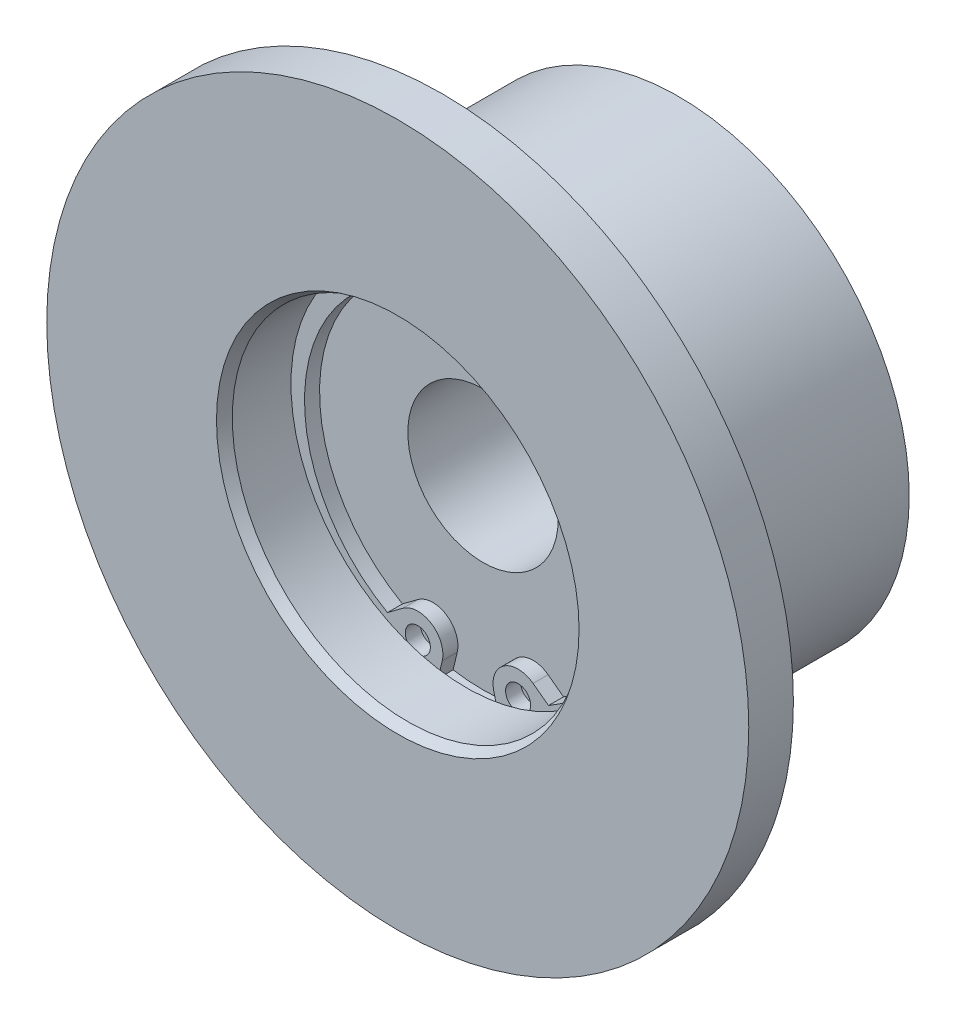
ISO-10303-21;
HEADER;
FILE_DESCRIPTION(('STEP AP214'),'2;1');
FILE_NAME('part.step','',(''),(''),'','','');
FILE_SCHEMA(('AUTOMOTIVE_DESIGN { 1 0 10303 214 1 1 1 1 }'));
ENDSEC;
DATA;
#1=APPLICATION_CONTEXT('core data for automotive mechanical design processes');
#2=APPLICATION_PROTOCOL_DEFINITION('international standard','automotive_design',2000,#1);
#3=PRODUCT_CONTEXT('',#1,'mechanical');
#4=PRODUCT('Part','Part','',(#3));
#5=PRODUCT_RELATED_PRODUCT_CATEGORY('part','',(#4));
#6=PRODUCT_DEFINITION_FORMATION('','',#4);
#7=PRODUCT_DEFINITION_CONTEXT('part definition',#1,'design');
#8=PRODUCT_DEFINITION('design','',#6,#7);
#9=PRODUCT_DEFINITION_SHAPE('','',#8);
#10=(LENGTH_UNIT() NAMED_UNIT(*) SI_UNIT(.MILLI.,.METRE.));
#11=(NAMED_UNIT(*) PLANE_ANGLE_UNIT() SI_UNIT($,.RADIAN.));
#12=(NAMED_UNIT(*) SI_UNIT($,.STERADIAN.) SOLID_ANGLE_UNIT());
#13=UNCERTAINTY_MEASURE_WITH_UNIT(LENGTH_MEASURE(1.E-05),#10,'distance_accuracy_value','');
#14=(GEOMETRIC_REPRESENTATION_CONTEXT(3) GLOBAL_UNCERTAINTY_ASSIGNED_CONTEXT((#13)) GLOBAL_UNIT_ASSIGNED_CONTEXT((#10,
#11,#12)) REPRESENTATION_CONTEXT('',''));
#15=CARTESIAN_POINT('',(0.,0.,0.));
#16=DIRECTION('',(0.,0.,1.));
#17=DIRECTION('',(1.,0.,0.));
#18=AXIS2_PLACEMENT_3D('',#15,#16,#17);
#19=CARTESIAN_POINT('',(0.,-0.9,7.1));
#20=DIRECTION('',(0.,0.,1.));
#21=DIRECTION('',(-1.,0.,0.));
#22=AXIS2_PLACEMENT_3D('',#19,#20,#21);
#23=CYLINDRICAL_SURFACE('',#22,16.3);
#24=CARTESIAN_POINT('',(0.,-0.9,7.));
#25=DIRECTION('',(0.,0.,1.));
#26=DIRECTION('',(1.,0.,0.));
#27=AXIS2_PLACEMENT_3D('',#24,#25,#26);
#28=CIRCLE('',#27,16.3);
#29=CARTESIAN_POINT('',(-8.02922574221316,-15.0852576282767,7.));
#30=VERTEX_POINT('',#29);
#31=CARTESIAN_POINT('',(8.02922574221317,-15.0852576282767,7.));
#32=VERTEX_POINT('',#31);
#33=EDGE_CURVE('E207',#30,#32,#28,.F.);
#34=ORIENTED_EDGE('',*,*,#33,.F.);
#35=DIRECTION('',(0.,0.,-1.));
#36=VECTOR('',#35,1.);
#37=CARTESIAN_POINT('',(-8.02922574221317,-15.0852576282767,7.1));
#38=LINE('',#37,#36);
#39=CARTESIAN_POINT('',(-8.02922574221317,-15.0852576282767,5.5));
#40=VERTEX_POINT('',#39);
#41=EDGE_CURVE('E127',#30,#40,#38,.T.);
#42=ORIENTED_EDGE('',*,*,#41,.T.);
#43=CARTESIAN_POINT('',(0.,-0.9,5.5));
#44=DIRECTION('',(0.,0.,-1.));
#45=DIRECTION('',(-1.,0.,0.));
#46=AXIS2_PLACEMENT_3D('',#43,#44,#45);
#47=CIRCLE('',#46,16.3);
#48=CARTESIAN_POINT('',(8.02922574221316,-15.0852576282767,5.5));
#49=VERTEX_POINT('',#48);
#50=EDGE_CURVE('E142',#40,#49,#47,.T.);
#51=ORIENTED_EDGE('',*,*,#50,.T.);
#52=DIRECTION('',(0.,0.,-1.));
#53=VECTOR('',#52,1.);
#54=CARTESIAN_POINT('',(8.02922574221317,-15.0852576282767,7.1));
#55=LINE('',#54,#53);
#56=EDGE_CURVE('E130',#32,#49,#55,.T.);
#57=ORIENTED_EDGE('',*,*,#56,.F.);
#58=EDGE_LOOP('',(#34,#42,#51,#57));
#59=FACE_BOUND('',#58,.T.);
#60=ADVANCED_FACE('F14',(#59),#23,.F.);
#61=CARTESIAN_POINT('',(6.49138441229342,-13.9421779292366,7.1));
#62=DIRECTION('',(-0.596553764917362,-0.802573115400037,0.));
#63=DIRECTION('',(-0.802573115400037,0.596553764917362,0.));
#64=AXIS2_PLACEMENT_3D('',#61,#62,#63);
#65=PLANE('',#64);
#66=DIRECTION('',(-0.802573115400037,0.596553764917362,0.));
#67=VECTOR('',#66,1.);
#68=CARTESIAN_POINT('',(6.49138441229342,-13.9421779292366,7.));
#69=LINE('',#68,#67);
#70=CARTESIAN_POINT('',(6.49138441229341,-13.9421779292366,7.));
#71=VERTEX_POINT('',#70);
#72=EDGE_CURVE('E209',#32,#71,#69,.T.);
#73=ORIENTED_EDGE('',*,*,#72,.F.);
#74=ORIENTED_EDGE('',*,*,#56,.T.);
#75=DIRECTION('',(-0.802573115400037,0.596553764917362,0.));
#76=VECTOR('',#75,1.);
#77=CARTESIAN_POINT('',(-7.95591287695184,-3.20348082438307,5.5));
#78=LINE('',#77,#76);
#79=CARTESIAN_POINT('',(6.49138441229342,-13.9421779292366,5.5));
#80=VERTEX_POINT('',#79);
#81=EDGE_CURVE('E138',#49,#80,#78,.T.);
#82=ORIENTED_EDGE('',*,*,#81,.T.);
#83=DIRECTION('',(0.,0.,-1.));
#84=VECTOR('',#83,1.);
#85=CARTESIAN_POINT('',(6.49138441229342,-13.9421779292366,7.1));
#86=LINE('',#85,#84);
#87=EDGE_CURVE('E122',#71,#80,#86,.T.);
#88=ORIENTED_EDGE('',*,*,#87,.F.);
#89=EDGE_LOOP('',(#73,#74,#82,#88));
#90=FACE_BOUND('',#89,.T.);
#91=ADVANCED_FACE('F217',(#90),#65,.F.);
#92=CARTESIAN_POINT('',(5.,-15.9486107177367,7.1));
#93=DIRECTION('',(0.,0.,1.));
#94=DIRECTION('',(-1.,0.,0.));
#95=AXIS2_PLACEMENT_3D('',#92,#93,#94);
#96=CYLINDRICAL_SURFACE('',#95,2.5);
#97=DIRECTION('',(0.,0.,-1.));
#98=VECTOR('',#97,1.);
#99=CARTESIAN_POINT('',(2.5678231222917,-16.526983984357,7.1));
#100=LINE('',#99,#98);
#101=CARTESIAN_POINT('',(2.5678231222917,-16.526983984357,7.));
#102=VERTEX_POINT('',#101);
#103=CARTESIAN_POINT('',(2.56782312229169,-16.526983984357,5.5));
#104=VERTEX_POINT('',#103);
#105=EDGE_CURVE('E40',#102,#104,#100,.T.);
#106=ORIENTED_EDGE('',*,*,#105,.F.);
#107=CARTESIAN_POINT('',(5.,-15.9486107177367,7.));
#108=DIRECTION('',(0.,0.,1.));
#109=DIRECTION('',(1.,0.,0.));
#110=AXIS2_PLACEMENT_3D('',#107,#108,#109);
#111=CIRCLE('',#110,2.5);
#112=EDGE_CURVE('E28',#102,#71,#111,.F.);
#113=ORIENTED_EDGE('',*,*,#112,.T.);
#114=ORIENTED_EDGE('',*,*,#87,.T.);
#115=CARTESIAN_POINT('',(5.,-15.9486107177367,5.5));
#116=DIRECTION('',(0.,0.,-1.));
#117=DIRECTION('',(-1.,0.,0.));
#118=AXIS2_PLACEMENT_3D('',#115,#116,#117);
#119=CIRCLE('',#118,2.5);
#120=EDGE_CURVE('E114',#104,#80,#119,.T.);
#121=ORIENTED_EDGE('',*,*,#120,.F.);
#122=EDGE_LOOP('',(#106,#113,#114,#121));
#123=FACE_BOUND('',#122,.T.);
#124=ADVANCED_FACE('F213',(#123),#96,.T.);
#125=CARTESIAN_POINT('',(-2.56782312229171,-16.526983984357,7.1));
#126=DIRECTION('',(-0.97287075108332,0.231349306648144,0.));
#127=DIRECTION('',(0.,0.,1.));
#128=AXIS2_PLACEMENT_3D('',#125,#126,#127);
#129=PLANE('',#128);
#130=DIRECTION('',(0.231349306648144,0.97287075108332,0.));
#131=VECTOR('',#130,1.);
#132=CARTESIAN_POINT('',(-2.56782312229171,-16.526983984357,7.));
#133=LINE('',#132,#131);
#134=CARTESIAN_POINT('',(-2.97957431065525,-18.2584812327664,7.));
#135=VERTEX_POINT('',#134);
#136=CARTESIAN_POINT('',(-2.5678231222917,-16.526983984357,7.));
#137=VERTEX_POINT('',#136);
#138=EDGE_CURVE('E90',#135,#137,#133,.T.);
#139=ORIENTED_EDGE('',*,*,#138,.F.);
#140=DIRECTION('',(0.,0.,1.));
#141=VECTOR('',#140,1.);
#142=CARTESIAN_POINT('',(-2.97957431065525,-18.2584812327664,17.6183293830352));
#143=LINE('',#142,#141);
#144=CARTESIAN_POINT('',(-2.97957431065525,-18.2584812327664,5.5));
#145=VERTEX_POINT('',#144);
#146=EDGE_CURVE('E101',#135,#145,#143,.F.);
#147=ORIENTED_EDGE('',*,*,#146,.T.);
#148=DIRECTION('',(0.231349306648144,0.97287075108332,0.));
#149=VECTOR('',#148,1.);
#150=CARTESIAN_POINT('',(2.97743793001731,6.79196329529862,5.5));
#151=LINE('',#150,#149);
#152=CARTESIAN_POINT('',(-2.5678231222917,-16.526983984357,5.5));
#153=VERTEX_POINT('',#152);
#154=EDGE_CURVE('E150',#145,#153,#151,.T.);
#155=ORIENTED_EDGE('',*,*,#154,.T.);
#156=DIRECTION('',(0.,0.,-1.));
#157=VECTOR('',#156,1.);
#158=CARTESIAN_POINT('',(-2.56782312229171,-16.526983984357,7.1));
#159=LINE('',#158,#157);
#160=EDGE_CURVE('E103',#137,#153,#159,.T.);
#161=ORIENTED_EDGE('',*,*,#160,.F.);
#162=EDGE_LOOP('',(#139,#147,#155,#161));
#163=FACE_BOUND('',#162,.T.);
#164=ADVANCED_FACE('F99',(#163),#129,.F.);
#165=CARTESIAN_POINT('',(-6.49138441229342,-13.9421779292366,7.1));
#166=DIRECTION('',(0.596553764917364,-0.802573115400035,0.));
#167=DIRECTION('',(0.,0.,-1.));
#168=AXIS2_PLACEMENT_3D('',#165,#166,#167);
#169=PLANE('',#168);
#170=DIRECTION('',(-0.802573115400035,-0.596553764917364,0.));
#171=VECTOR('',#170,1.);
#172=CARTESIAN_POINT('',(-6.49138441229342,-13.9421779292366,7.));
#173=LINE('',#172,#171);
#174=CARTESIAN_POINT('',(-6.49138441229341,-13.9421779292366,7.));
#175=VERTEX_POINT('',#174);
#176=EDGE_CURVE('E205',#175,#30,#173,.T.);
#177=ORIENTED_EDGE('',*,*,#176,.F.);
#178=DIRECTION('',(0.,0.,-1.));
#179=VECTOR('',#178,1.);
#180=CARTESIAN_POINT('',(-6.49138441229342,-13.9421779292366,7.1));
#181=LINE('',#180,#179);
#182=CARTESIAN_POINT('',(-6.49138441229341,-13.9421779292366,5.5));
#183=VERTEX_POINT('',#182);
#184=EDGE_CURVE('E123',#175,#183,#181,.T.);
#185=ORIENTED_EDGE('',*,*,#184,.T.);
#186=DIRECTION('',(-0.802573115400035,-0.596553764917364,0.));
#187=VECTOR('',#186,1.);
#188=CARTESIAN_POINT('',(7.95591287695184,-3.203480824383,5.5));
#189=LINE('',#188,#187);
#190=EDGE_CURVE('E146',#183,#40,#189,.T.);
#191=ORIENTED_EDGE('',*,*,#190,.T.);
#192=ORIENTED_EDGE('',*,*,#41,.F.);
#193=EDGE_LOOP('',(#177,#185,#191,#192));
#194=FACE_BOUND('',#193,.T.);
#195=ADVANCED_FACE('F235',(#194),#169,.F.);
#196=CARTESIAN_POINT('',(-5.,-15.9486107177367,7.1));
#197=DIRECTION('',(0.,0.,1.));
#198=DIRECTION('',(-1.,0.,0.));
#199=AXIS2_PLACEMENT_3D('',#196,#197,#198);
#200=CYLINDRICAL_SURFACE('',#199,2.5);
#201=ORIENTED_EDGE('',*,*,#184,.F.);
#202=CARTESIAN_POINT('',(-5.,-15.9486107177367,7.));
#203=DIRECTION('',(0.,0.,1.));
#204=DIRECTION('',(1.,0.,0.));
#205=AXIS2_PLACEMENT_3D('',#202,#203,#204);
#206=CIRCLE('',#205,2.5);
#207=EDGE_CURVE('E105',#175,#137,#206,.F.);
#208=ORIENTED_EDGE('',*,*,#207,.T.);
#209=ORIENTED_EDGE('',*,*,#160,.T.);
#210=CARTESIAN_POINT('',(-5.,-15.9486107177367,5.5));
#211=DIRECTION('',(0.,0.,-1.));
#212=DIRECTION('',(-1.,0.,0.));
#213=AXIS2_PLACEMENT_3D('',#210,#211,#212);
#214=CIRCLE('',#213,2.5);
#215=EDGE_CURVE('E152',#183,#153,#214,.T.);
#216=ORIENTED_EDGE('',*,*,#215,.F.);
#217=EDGE_LOOP('',(#201,#208,#209,#216));
#218=FACE_BOUND('',#217,.T.);
#219=ADVANCED_FACE('F16',(#218),#200,.T.);
#220=CARTESIAN_POINT('',(2.5678231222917,-16.526983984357,7.1));
#221=DIRECTION('',(0.972870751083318,0.231349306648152,0.));
#222=DIRECTION('',(0.,0.,-1.));
#223=AXIS2_PLACEMENT_3D('',#220,#221,#222);
#224=PLANE('',#223);
#225=DIRECTION('',(0.231349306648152,-0.972870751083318,0.));
#226=VECTOR('',#225,1.);
#227=CARTESIAN_POINT('',(2.5678231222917,-16.526983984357,7.));
#228=LINE('',#227,#226);
#229=CARTESIAN_POINT('',(2.97957431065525,-18.2584812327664,7.));
#230=VERTEX_POINT('',#229);
#231=EDGE_CURVE('E9',#102,#230,#228,.T.);
#232=ORIENTED_EDGE('',*,*,#231,.F.);
#233=ORIENTED_EDGE('',*,*,#105,.T.);
#234=DIRECTION('',(0.231349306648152,-0.972870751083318,0.));
#235=VECTOR('',#234,1.);
#236=CARTESIAN_POINT('',(-2.97743793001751,6.79196329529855,5.5));
#237=LINE('',#236,#235);
#238=CARTESIAN_POINT('',(2.97957431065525,-18.2584812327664,5.5));
#239=VERTEX_POINT('',#238);
#240=EDGE_CURVE('E112',#104,#239,#237,.T.);
#241=ORIENTED_EDGE('',*,*,#240,.T.);
#242=DIRECTION('',(0.,0.,1.));
#243=VECTOR('',#242,1.);
#244=CARTESIAN_POINT('',(2.97957431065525,-18.2584812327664,17.6183293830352));
#245=LINE('',#244,#243);
#246=EDGE_CURVE('E22',#239,#230,#245,.T.);
#247=ORIENTED_EDGE('',*,*,#246,.T.);
#248=EDGE_LOOP('',(#232,#233,#241,#247));
#249=FACE_BOUND('',#248,.T.);
#250=ADVANCED_FACE('F223',(#249),#224,.F.);
#251=CARTESIAN_POINT('',(0.,0.,8.5));
#252=DIRECTION('',(0.,0.,1.));
#253=DIRECTION('',(1.,0.,0.));
#254=AXIS2_PLACEMENT_3D('',#251,#252,#253);
#255=CONICAL_SURFACE('',#254,23.,1.48352986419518);
#256=CARTESIAN_POINT('',(0.,0.,9.54986396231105));
#257=DIRECTION('',(0.,0.,1.));
#258=DIRECTION('',(1.,0.,0.));
#259=AXIS2_PLACEMENT_3D('',#256,#257,#258);
#260=CIRCLE('',#259,35.);
#261=CARTESIAN_POINT('',(35.,0.,9.54986396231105));
#262=VERTEX_POINT('',#261);
#263=EDGE_CURVE('E171',#262,#262,#260,.T.);
#264=ORIENTED_EDGE('',*,*,#263,.F.);
#265=EDGE_LOOP('',(#264));
#266=FACE_BOUND('',#265,.T.);
#267=CARTESIAN_POINT('',(0.,0.,8.5));
#268=DIRECTION('',(0.,0.,1.));
#269=DIRECTION('',(1.,0.,0.));
#270=AXIS2_PLACEMENT_3D('',#267,#268,#269);
#271=CIRCLE('',#270,23.);
#272=CARTESIAN_POINT('',(23.,0.,8.5));
#273=VERTEX_POINT('',#272);
#274=EDGE_CURVE('E164',#273,#273,#271,.T.);
#275=ORIENTED_EDGE('',*,*,#274,.T.);
#276=EDGE_LOOP('',(#275));
#277=FACE_BOUND('',#276,.T.);
#278=ADVANCED_FACE('F225',(#266,#277),#255,.T.);
#279=CARTESIAN_POINT('',(0.,0.,17.6183293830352));
#280=DIRECTION('',(0.,0.,1.));
#281=DIRECTION('',(1.,0.,0.));
#282=AXIS2_PLACEMENT_3D('',#279,#280,#281);
#283=CYLINDRICAL_SURFACE('',#282,35.);
#284=CARTESIAN_POINT('',(0.,0.,14.));
#285=DIRECTION('',(0.,0.,1.));
#286=DIRECTION('',(1.,0.,0.));
#287=AXIS2_PLACEMENT_3D('',#284,#285,#286);
#288=CIRCLE('',#287,35.);
#289=CARTESIAN_POINT('',(35.,0.,14.));
#290=VERTEX_POINT('',#289);
#291=EDGE_CURVE('E174',#290,#290,#288,.T.);
#292=ORIENTED_EDGE('',*,*,#291,.F.);
#293=EDGE_LOOP('',(#292));
#294=FACE_BOUND('',#293,.T.);
#295=ORIENTED_EDGE('',*,*,#263,.T.);
#296=EDGE_LOOP('',(#295));
#297=FACE_BOUND('',#296,.T.);
#298=ADVANCED_FACE('F232',(#294,#297),#283,.T.);
#299=CARTESIAN_POINT('',(0.,0.,17.6183293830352));
#300=DIRECTION('',(0.,0.,1.));
#301=DIRECTION('',(1.,0.,0.));
#302=AXIS2_PLACEMENT_3D('',#299,#300,#301);
#303=CYLINDRICAL_SURFACE('',#302,23.);
#304=ORIENTED_EDGE('',*,*,#274,.F.);
#305=EDGE_LOOP('',(#304));
#306=FACE_BOUND('',#305,.T.);
#307=CARTESIAN_POINT('',(0.,0.,-14.));
#308=DIRECTION('',(0.,0.,1.));
#309=DIRECTION('',(1.,0.,0.));
#310=AXIS2_PLACEMENT_3D('',#307,#308,#309);
#311=CIRCLE('',#310,23.);
#312=CARTESIAN_POINT('',(23.,0.,-14.));
#313=VERTEX_POINT('',#312);
#314=EDGE_CURVE('E168',#313,#313,#311,.T.);
#315=ORIENTED_EDGE('',*,*,#314,.T.);
#316=EDGE_LOOP('',(#315));
#317=FACE_BOUND('',#316,.T.);
#318=ADVANCED_FACE('F313',(#306,#317),#303,.T.);
#319=CARTESIAN_POINT('',(0.,35.,14.));
#320=DIRECTION('',(0.,0.,-1.));
#321=DIRECTION('',(-1.,0.,0.));
#322=AXIS2_PLACEMENT_3D('',#319,#320,#321);
#323=PLANE('',#322);
#324=CARTESIAN_POINT('',(0.,0.,14.));
#325=DIRECTION('',(0.,0.,1.));
#326=DIRECTION('',(1.,0.,0.));
#327=AXIS2_PLACEMENT_3D('',#324,#325,#326);
#328=CIRCLE('',#327,18.0773502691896);
#329=CARTESIAN_POINT('',(18.0773502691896,0.,14.));
#330=VERTEX_POINT('',#329);
#331=EDGE_CURVE('E177',#330,#330,#328,.T.);
#332=ORIENTED_EDGE('',*,*,#331,.F.);
#333=EDGE_LOOP('',(#332));
#334=FACE_BOUND('',#333,.T.);
#335=ORIENTED_EDGE('',*,*,#291,.T.);
#336=EDGE_LOOP('',(#335));
#337=FACE_BOUND('',#336,.T.);
#338=ADVANCED_FACE('F290',(#334,#337),#323,.F.);
#339=CARTESIAN_POINT('',(0.,14.5,-14.));
#340=DIRECTION('',(0.,0.,1.));
#341=DIRECTION('',(1.,0.,0.));
#342=AXIS2_PLACEMENT_3D('',#339,#340,#341);
#343=PLANE('',#342);
#344=ORIENTED_EDGE('',*,*,#314,.F.);
#345=EDGE_LOOP('',(#344));
#346=FACE_BOUND('',#345,.T.);
#347=CARTESIAN_POINT('',(0.,0.,-14.));
#348=DIRECTION('',(0.,0.,1.));
#349=DIRECTION('',(1.,0.,0.));
#350=AXIS2_PLACEMENT_3D('',#347,#348,#349);
#351=CIRCLE('',#350,14.5);
#352=CARTESIAN_POINT('',(14.5,0.,-14.));
#353=VERTEX_POINT('',#352);
#354=EDGE_CURVE('E193',#353,#353,#351,.T.);
#355=ORIENTED_EDGE('',*,*,#354,.T.);
#356=EDGE_LOOP('',(#355));
#357=FACE_BOUND('',#356,.T.);
#358=ADVANCED_FACE('F286',(#346,#357),#343,.F.);
#359=CARTESIAN_POINT('',(0.,0.,14.));
#360=DIRECTION('',(0.,0.,1.));
#361=DIRECTION('',(1.,0.,0.));
#362=AXIS2_PLACEMENT_3D('',#359,#360,#361);
#363=CONICAL_SURFACE('',#362,18.0773502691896,0.5235987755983);
#364=CARTESIAN_POINT('',(0.,0.,13.));
#365=DIRECTION('',(0.,0.,1.));
#366=DIRECTION('',(1.,0.,0.));
#367=AXIS2_PLACEMENT_3D('',#364,#365,#366);
#368=CIRCLE('',#367,17.5);
#369=CARTESIAN_POINT('',(17.5,0.,13.));
#370=VERTEX_POINT('',#369);
#371=EDGE_CURVE('E180',#370,#370,#368,.T.);
#372=ORIENTED_EDGE('',*,*,#371,.F.);
#373=EDGE_LOOP('',(#372));
#374=FACE_BOUND('',#373,.T.);
#375=ORIENTED_EDGE('',*,*,#331,.T.);
#376=EDGE_LOOP('',(#375));
#377=FACE_BOUND('',#376,.T.);
#378=ADVANCED_FACE('F289',(#374,#377),#363,.F.);
#379=CARTESIAN_POINT('',(0.,0.,17.6183293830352));
#380=DIRECTION('',(0.,0.,1.));
#381=DIRECTION('',(1.,0.,0.));
#382=AXIS2_PLACEMENT_3D('',#379,#380,#381);
#383=CYLINDRICAL_SURFACE('',#382,14.5);
#384=ORIENTED_EDGE('',*,*,#354,.F.);
#385=EDGE_LOOP('',(#384));
#386=FACE_BOUND('',#385,.T.);
#387=CARTESIAN_POINT('',(0.,0.,-5.5));
#388=DIRECTION('',(0.,0.,1.));
#389=DIRECTION('',(1.,0.,0.));
#390=AXIS2_PLACEMENT_3D('',#387,#388,#389);
#391=CIRCLE('',#390,14.5);
#392=CARTESIAN_POINT('',(14.5,0.,-5.5));
#393=VERTEX_POINT('',#392);
#394=EDGE_CURVE('E190',#393,#393,#391,.T.);
#395=ORIENTED_EDGE('',*,*,#394,.T.);
#396=EDGE_LOOP('',(#395));
#397=FACE_BOUND('',#396,.T.);
#398=ADVANCED_FACE('F292',(#386,#397),#383,.F.);
#399=CARTESIAN_POINT('',(0.,0.,17.6183293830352));
#400=DIRECTION('',(0.,0.,1.));
#401=DIRECTION('',(1.,0.,0.));
#402=AXIS2_PLACEMENT_3D('',#399,#400,#401);
#403=CYLINDRICAL_SURFACE('',#402,17.5);
#404=CARTESIAN_POINT('',(0.,0.,7.15));
#405=DIRECTION('',(0.,0.,1.));
#406=DIRECTION('',(1.,0.,0.));
#407=AXIS2_PLACEMENT_3D('',#404,#405,#406);
#408=CIRCLE('',#407,17.5);
#409=CARTESIAN_POINT('',(17.5,0.,7.15));
#410=VERTEX_POINT('',#409);
#411=EDGE_CURVE('E165',#410,#410,#408,.F.);
#412=ORIENTED_EDGE('',*,*,#411,.T.);
#413=EDGE_LOOP('',(#412));
#414=FACE_BOUND('',#413,.T.);
#415=ORIENTED_EDGE('',*,*,#371,.T.);
#416=EDGE_LOOP('',(#415));
#417=FACE_BOUND('',#416,.T.);
#418=ADVANCED_FACE('F295',(#414,#417),#403,.F.);
#419=CARTESIAN_POINT('',(0.,14.5,-5.5));
#420=DIRECTION('',(0.,0.,1.));
#421=DIRECTION('',(1.,0.,0.));
#422=AXIS2_PLACEMENT_3D('',#419,#420,#421);
#423=PLANE('',#422);
#424=ORIENTED_EDGE('',*,*,#394,.F.);
#425=EDGE_LOOP('',(#424));
#426=FACE_BOUND('',#425,.T.);
#427=CARTESIAN_POINT('',(0.,0.,-5.5));
#428=DIRECTION('',(0.,0.,1.));
#429=DIRECTION('',(1.,0.,0.));
#430=AXIS2_PLACEMENT_3D('',#427,#428,#429);
#431=CIRCLE('',#430,7.5);
#432=CARTESIAN_POINT('',(7.5,0.,-5.5));
#433=VERTEX_POINT('',#432);
#434=EDGE_CURVE('E187',#433,#433,#431,.T.);
#435=ORIENTED_EDGE('',*,*,#434,.T.);
#436=EDGE_LOOP('',(#435));
#437=FACE_BOUND('',#436,.T.);
#438=ADVANCED_FACE('F284',(#426,#437),#423,.F.);
#439=CARTESIAN_POINT('',(0.,0.,7.15));
#440=DIRECTION('',(0.,0.,1.));
#441=DIRECTION('',(1.,0.,0.));
#442=AXIS2_PLACEMENT_3D('',#439,#440,#441);
#443=PLANE('',#442);
#444=CARTESIAN_POINT('',(0.,0.,7.15));
#445=DIRECTION('',(0.,0.,1.));
#446=DIRECTION('',(1.,0.,0.));
#447=AXIS2_PLACEMENT_3D('',#444,#445,#446);
#448=CIRCLE('',#447,18.5);
#449=CARTESIAN_POINT('',(18.5,0.,7.15));
#450=VERTEX_POINT('',#449);
#451=EDGE_CURVE('E126',#450,#450,#448,.T.);
#452=ORIENTED_EDGE('',*,*,#451,.F.);
#453=EDGE_LOOP('',(#452));
#454=FACE_BOUND('',#453,.T.);
#455=ORIENTED_EDGE('',*,*,#411,.F.);
#456=EDGE_LOOP('',(#455));
#457=FACE_BOUND('',#456,.T.);
#458=ADVANCED_FACE('F281',(#454,#457),#443,.F.);
#459=CARTESIAN_POINT('',(0.,0.,17.6183293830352));
#460=DIRECTION('',(0.,0.,1.));
#461=DIRECTION('',(1.,0.,0.));
#462=AXIS2_PLACEMENT_3D('',#459,#460,#461);
#463=CYLINDRICAL_SURFACE('',#462,18.5);
#464=CARTESIAN_POINT('',(0.,0.,7.));
#465=DIRECTION('',(0.,0.,1.));
#466=DIRECTION('',(1.,0.,0.));
#467=AXIS2_PLACEMENT_3D('',#464,#465,#466);
#468=CIRCLE('',#467,18.5);
#469=EDGE_CURVE('E86',#230,#135,#468,.T.);
#470=ORIENTED_EDGE('',*,*,#469,.F.);
#471=ORIENTED_EDGE('',*,*,#246,.F.);
#472=CARTESIAN_POINT('',(0.,0.,5.5));
#473=DIRECTION('',(0.,0.,1.));
#474=DIRECTION('',(1.,0.,0.));
#475=AXIS2_PLACEMENT_3D('',#472,#473,#474);
#476=CIRCLE('',#475,18.5);
#477=EDGE_CURVE('E111',#145,#239,#476,.T.);
#478=ORIENTED_EDGE('',*,*,#477,.F.);
#479=ORIENTED_EDGE('',*,*,#146,.F.);
#480=EDGE_LOOP('',(#470,#471,#478,#479));
#481=FACE_BOUND('',#480,.T.);
#482=ORIENTED_EDGE('',*,*,#451,.T.);
#483=EDGE_LOOP('',(#482));
#484=FACE_BOUND('',#483,.T.);
#485=ADVANCED_FACE('F108',(#481,#484),#463,.F.);
#486=CARTESIAN_POINT('',(0.,0.,17.6183293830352));
#487=DIRECTION('',(0.,0.,1.));
#488=DIRECTION('',(1.,0.,0.));
#489=AXIS2_PLACEMENT_3D('',#486,#487,#488);
#490=CYLINDRICAL_SURFACE('',#489,7.5);
#491=ORIENTED_EDGE('',*,*,#434,.F.);
#492=EDGE_LOOP('',(#491));
#493=FACE_BOUND('',#492,.T.);
#494=CARTESIAN_POINT('',(0.,0.,5.5));
#495=DIRECTION('',(0.,0.,1.));
#496=DIRECTION('',(1.,0.,0.));
#497=AXIS2_PLACEMENT_3D('',#494,#495,#496);
#498=CIRCLE('',#497,7.5);
#499=CARTESIAN_POINT('',(7.5,0.,5.5));
#500=VERTEX_POINT('',#499);
#501=EDGE_CURVE('E184',#500,#500,#498,.T.);
#502=ORIENTED_EDGE('',*,*,#501,.T.);
#503=EDGE_LOOP('',(#502));
#504=FACE_BOUND('',#503,.T.);
#505=ADVANCED_FACE('F278',(#493,#504),#490,.F.);
#506=CARTESIAN_POINT('',(0.,7.5,5.5));
#507=DIRECTION('',(0.,0.,-1.));
#508=DIRECTION('',(-1.,0.,0.));
#509=AXIS2_PLACEMENT_3D('',#506,#507,#508);
#510=PLANE('',#509);
#511=ORIENTED_EDGE('',*,*,#501,.F.);
#512=EDGE_LOOP('',(#511));
#513=FACE_BOUND('',#512,.T.);
#514=ORIENTED_EDGE('',*,*,#240,.F.);
#515=ORIENTED_EDGE('',*,*,#120,.T.);
#516=ORIENTED_EDGE('',*,*,#81,.F.);
#517=ORIENTED_EDGE('',*,*,#50,.F.);
#518=ORIENTED_EDGE('',*,*,#190,.F.);
#519=ORIENTED_EDGE('',*,*,#215,.T.);
#520=ORIENTED_EDGE('',*,*,#154,.F.);
#521=ORIENTED_EDGE('',*,*,#477,.T.);
#522=EDGE_LOOP('',(#514,#515,#516,#517,#518,#519,#520,#521));
#523=FACE_BOUND('',#522,.T.);
#524=ADVANCED_FACE('F222',(#513,#523),#510,.F.);
#525=CARTESIAN_POINT('',(0.,0.,7.));
#526=DIRECTION('',(0.,0.,1.));
#527=DIRECTION('',(1.,0.,0.));
#528=AXIS2_PLACEMENT_3D('',#525,#526,#527);
#529=PLANE('',#528);
#530=ORIENTED_EDGE('',*,*,#138,.T.);
#531=ORIENTED_EDGE('',*,*,#207,.F.);
#532=ORIENTED_EDGE('',*,*,#176,.T.);
#533=ORIENTED_EDGE('',*,*,#33,.T.);
#534=ORIENTED_EDGE('',*,*,#72,.T.);
#535=ORIENTED_EDGE('',*,*,#112,.F.);
#536=ORIENTED_EDGE('',*,*,#231,.T.);
#537=ORIENTED_EDGE('',*,*,#469,.T.);
#538=EDGE_LOOP('',(#530,#531,#532,#533,#534,#535,#536,#537));
#539=FACE_BOUND('',#538,.T.);
#540=CARTESIAN_POINT('',(-5.,-15.9486107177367,7.));
#541=DIRECTION('',(0.,0.,1.));
#542=DIRECTION('',(1.,0.,0.));
#543=AXIS2_PLACEMENT_3D('',#540,#541,#542);
#544=CIRCLE('',#543,1.25);
#545=CARTESIAN_POINT('',(-3.75,-15.9486107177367,7.));
#546=VERTEX_POINT('',#545);
#547=EDGE_CURVE('E104',#546,#546,#544,.F.);
#548=ORIENTED_EDGE('',*,*,#547,.T.);
#549=EDGE_LOOP('',(#548));
#550=FACE_BOUND('',#549,.T.);
#551=CARTESIAN_POINT('',(5.,-15.9486107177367,7.));
#552=DIRECTION('',(0.,0.,1.));
#553=DIRECTION('',(1.,0.,0.));
#554=AXIS2_PLACEMENT_3D('',#551,#552,#553);
#555=CIRCLE('',#554,1.25);
#556=CARTESIAN_POINT('',(6.25,-15.9486107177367,7.));
#557=VERTEX_POINT('',#556);
#558=EDGE_CURVE('E119',#557,#557,#555,.F.);
#559=ORIENTED_EDGE('',*,*,#558,.T.);
#560=EDGE_LOOP('',(#559));
#561=FACE_BOUND('',#560,.T.);
#562=ADVANCED_FACE('F88',(#539,#550,#561),#529,.T.);
#563=CARTESIAN_POINT('',(-5.,-15.9486107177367,5.5));
#564=DIRECTION('',(0.,0.,-1.));
#565=DIRECTION('',(-1.,0.,0.));
#566=AXIS2_PLACEMENT_3D('',#563,#564,#565);
#567=CIRCLE('',#566,1.25);
#568=CARTESIAN_POINT('',(-6.25,-15.9486107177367,5.5));
#569=VERTEX_POINT('',#568);
#570=EDGE_CURVE('E156',#569,#569,#567,.T.);
#571=ORIENTED_EDGE('',*,*,#570,.F.);
#572=EDGE_LOOP('',(#571));
#573=FACE_BOUND('',#572,.T.);
#574=ADVANCED_FACE('F258',(#573),#510,.F.);
#575=CARTESIAN_POINT('',(-5.,-15.9486107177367,7.1));
#576=DIRECTION('',(0.,0.,1.));
#577=DIRECTION('',(-1.,0.,0.));
#578=AXIS2_PLACEMENT_3D('',#575,#576,#577);
#579=CYLINDRICAL_SURFACE('',#578,1.25);
#580=ORIENTED_EDGE('',*,*,#570,.T.);
#581=EDGE_LOOP('',(#580));
#582=FACE_BOUND('',#581,.T.);
#583=ORIENTED_EDGE('',*,*,#547,.F.);
#584=EDGE_LOOP('',(#583));
#585=FACE_BOUND('',#584,.T.);
#586=ADVANCED_FACE('F256',(#582,#585),#579,.F.);
#587=CARTESIAN_POINT('',(5.,-15.9486107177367,5.5));
#588=DIRECTION('',(0.,0.,-1.));
#589=DIRECTION('',(-1.,0.,0.));
#590=AXIS2_PLACEMENT_3D('',#587,#588,#589);
#591=CIRCLE('',#590,1.25);
#592=CARTESIAN_POINT('',(3.75,-15.9486107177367,5.5));
#593=VERTEX_POINT('',#592);
#594=EDGE_CURVE('E160',#593,#593,#591,.T.);
#595=ORIENTED_EDGE('',*,*,#594,.F.);
#596=EDGE_LOOP('',(#595));
#597=FACE_BOUND('',#596,.T.);
#598=ADVANCED_FACE('F252',(#597),#510,.F.);
#599=CARTESIAN_POINT('',(5.,-15.9486107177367,7.1));
#600=DIRECTION('',(0.,0.,1.));
#601=DIRECTION('',(-1.,0.,0.));
#602=AXIS2_PLACEMENT_3D('',#599,#600,#601);
#603=CYLINDRICAL_SURFACE('',#602,1.25);
#604=ORIENTED_EDGE('',*,*,#594,.T.);
#605=EDGE_LOOP('',(#604));
#606=FACE_BOUND('',#605,.T.);
#607=ORIENTED_EDGE('',*,*,#558,.F.);
#608=EDGE_LOOP('',(#607));
#609=FACE_BOUND('',#608,.T.);
#610=ADVANCED_FACE('F249',(#606,#609),#603,.F.);
#611=CLOSED_SHELL('',(#60,#91,#124,#164,#195,#219,#250,#278,#298,#318,#338,#358,#378,#398,#418,
#438,#458,#485,#505,#524,#562,#574,#586,#598,#610));
#612=MANIFOLD_SOLID_BREP('B1',#611);
#613=ADVANCED_BREP_SHAPE_REPRESENTATION('',(#18,#612),#14);
#614=SHAPE_DEFINITION_REPRESENTATION(#9,#613);
ENDSEC;
END-ISO-10303-21;
